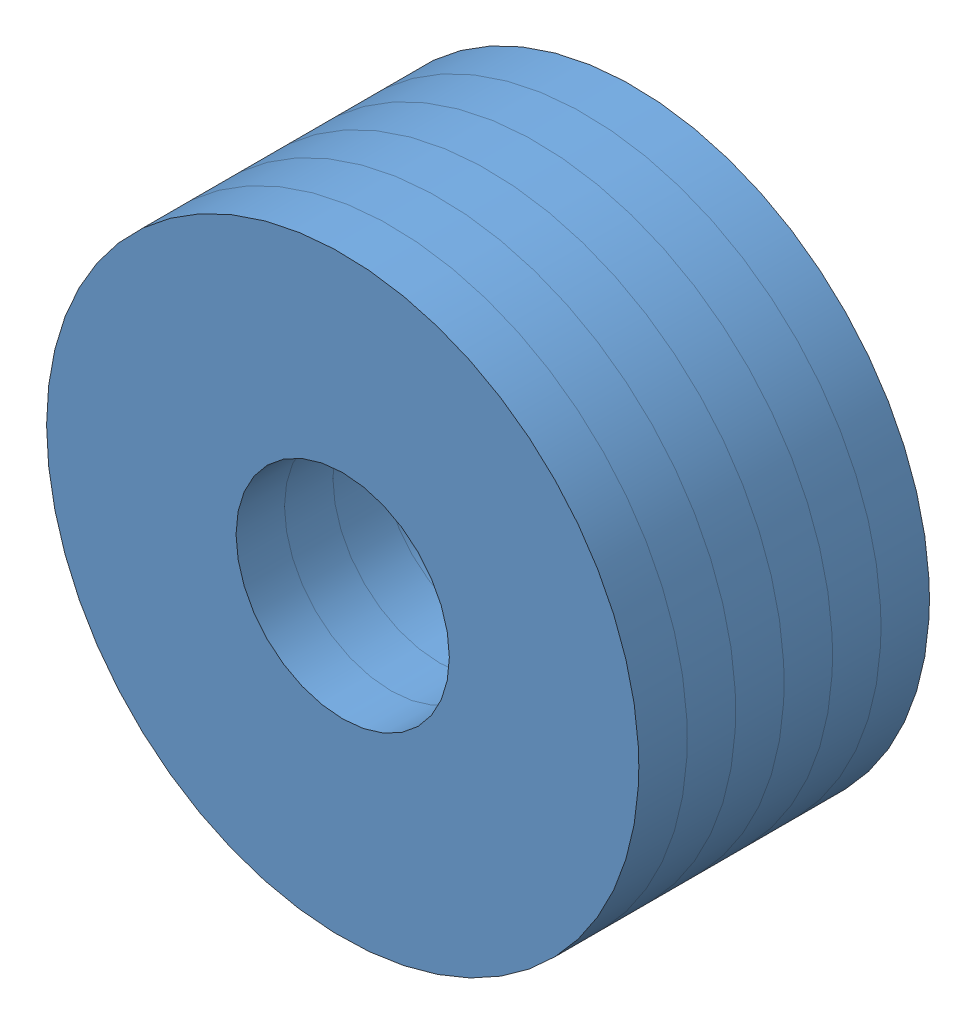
SolidWorks assembly Bigwasher_x6.SLDASM, configuration Default (file format 13000). Lengths in mm.
Overall size (23.6 23.6 11.58).
6 component instances, 1 part files, 5 mates.
Components (placement in the parent):
- BigWasher-1: BigWasher.SLDPRT [Default] at origin size (23.6 23.6 1.93)
- BigWasher-2: BigWasher.SLDPRT [Default] at (0 0 1.93) size (23.6 23.6 1.93)
- BigWasher-3: BigWasher.SLDPRT [Default] at (0 0 3.86) size (23.6 23.6 1.93)
- BigWasher-4: BigWasher.SLDPRT [Default] at (0 0 5.79) size (23.6 23.6 1.93)
- BigWasher-5: BigWasher.SLDPRT [Default] at (0 0 7.72) size (23.6 23.6 1.93)
- BigWasher-6: BigWasher.SLDPRT [Default] at (0 0 9.65) size (23.6 23.6 1.93)
Mates (geometry in assembly coordinates):
- Coincident4: coincident aligned: circle of BigWasher-1; circle of BigWasher-2
- Coincident5: coincident aligned: circle of BigWasher-2; circle of BigWasher-3
- Coincident6: coincident aligned: circle of BigWasher-3; circle of BigWasher-4
- Coincident7: coincident aligned: circle of BigWasher-4; circle of BigWasher-5
- Coincident8: coincident aligned: circle of BigWasher-5; circle of BigWasher-6
